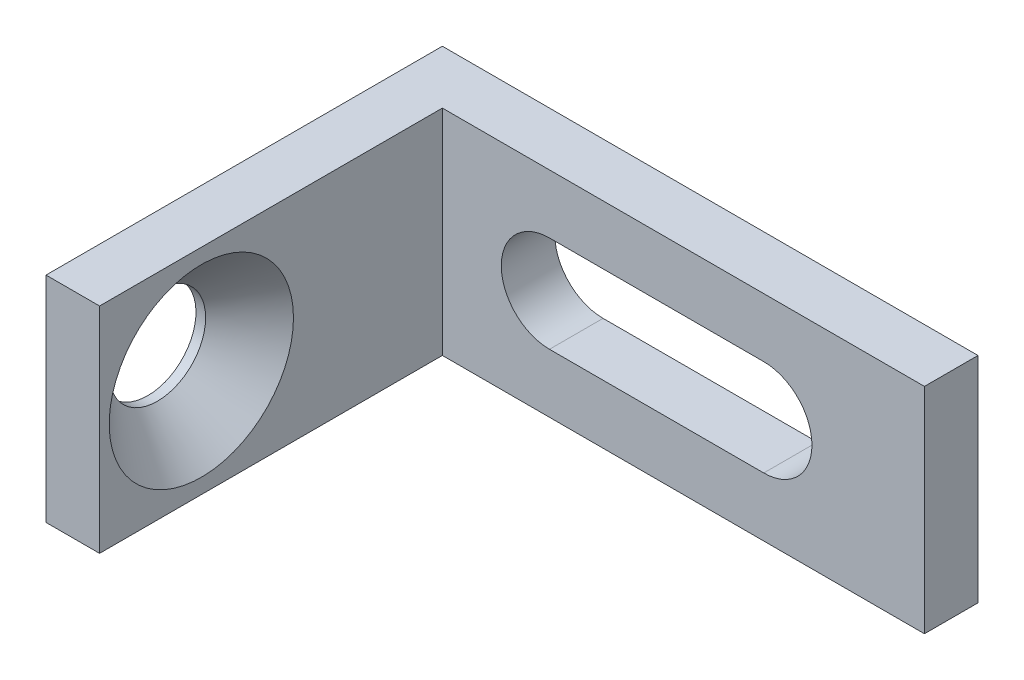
ISO-10303-21;
HEADER;
FILE_DESCRIPTION(('STEP AP214'),'2;1');
FILE_NAME('part.step','',(''),(''),'','','');
FILE_SCHEMA(('AUTOMOTIVE_DESIGN { 1 0 10303 214 1 1 1 1 }'));
ENDSEC;
DATA;
#1=APPLICATION_CONTEXT('core data for automotive mechanical design processes');
#2=APPLICATION_PROTOCOL_DEFINITION('international standard','automotive_design',2000,#1);
#3=PRODUCT_CONTEXT('',#1,'mechanical');
#4=PRODUCT('Part','Part','',(#3));
#5=PRODUCT_RELATED_PRODUCT_CATEGORY('part','',(#4));
#6=PRODUCT_DEFINITION_FORMATION('','',#4);
#7=PRODUCT_DEFINITION_CONTEXT('part definition',#1,'design');
#8=PRODUCT_DEFINITION('design','',#6,#7);
#9=PRODUCT_DEFINITION_SHAPE('','',#8);
#10=(LENGTH_UNIT() NAMED_UNIT(*) SI_UNIT(.MILLI.,.METRE.));
#11=(NAMED_UNIT(*) PLANE_ANGLE_UNIT() SI_UNIT($,.RADIAN.));
#12=(NAMED_UNIT(*) SI_UNIT($,.STERADIAN.) SOLID_ANGLE_UNIT());
#13=UNCERTAINTY_MEASURE_WITH_UNIT(LENGTH_MEASURE(1.E-05),#10,'distance_accuracy_value','');
#14=(GEOMETRIC_REPRESENTATION_CONTEXT(3) GLOBAL_UNCERTAINTY_ASSIGNED_CONTEXT((#13)) GLOBAL_UNIT_ASSIGNED_CONTEXT((#10,
#11,#12)) REPRESENTATION_CONTEXT('',''));
#15=CARTESIAN_POINT('',(0.,0.,0.));
#16=DIRECTION('',(0.,0.,1.));
#17=DIRECTION('',(1.,0.,0.));
#18=AXIS2_PLACEMENT_3D('',#15,#16,#17);
#19=CARTESIAN_POINT('',(5.00000000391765,0.,0.));
#20=DIRECTION('',(1.,0.,0.));
#21=DIRECTION('',(0.,0.,-1.));
#22=AXIS2_PLACEMENT_3D('',#19,#20,#21);
#23=CONICAL_SURFACE('',#22,8.59999999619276,0.785398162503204);
#24=CARTESIAN_POINT('',(5.00000000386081,0.,0.));
#25=DIRECTION('',(1.,0.,0.));
#26=DIRECTION('',(0.,0.,-1.));
#27=AXIS2_PLACEMENT_3D('',#24,#25,#26);
#28=CIRCLE('',#27,8.59999999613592);
#29=CARTESIAN_POINT('',(5.00000000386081,0.,-8.59999999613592));
#30=VERTEX_POINT('',#29);
#31=EDGE_CURVE('E18',#30,#30,#28,.T.);
#32=ORIENTED_EDGE('',*,*,#31,.T.);
#33=EDGE_LOOP('',(#32));
#34=FACE_BOUND('',#33,.T.);
#35=CARTESIAN_POINT('',(0.9,0.,0.));
#36=DIRECTION('',(-1.,0.,0.));
#37=DIRECTION('',(0.,-1.,0.));
#38=AXIS2_PLACEMENT_3D('',#35,#36,#37);
#39=CIRCLE('',#38,4.5);
#40=CARTESIAN_POINT('',(0.899999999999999,-4.5,0.));
#41=VERTEX_POINT('',#40);
#42=EDGE_CURVE('E130',#41,#41,#39,.T.);
#43=ORIENTED_EDGE('',*,*,#42,.T.);
#44=EDGE_LOOP('',(#43));
#45=FACE_BOUND('',#44,.T.);
#46=ADVANCED_FACE('F15',(#34,#45),#23,.F.);
#47=CARTESIAN_POINT('',(2.5,0.,0.));
#48=DIRECTION('',(-1.,0.,0.));
#49=DIRECTION('',(0.,-1.,0.));
#50=AXIS2_PLACEMENT_3D('',#47,#48,#49);
#51=CYLINDRICAL_SURFACE('',#50,4.5);
#52=CARTESIAN_POINT('',(0.,0.,0.));
#53=DIRECTION('',(-1.,0.,0.));
#54=DIRECTION('',(0.,-1.,0.));
#55=AXIS2_PLACEMENT_3D('',#52,#53,#54);
#56=CIRCLE('',#55,4.5);
#57=CARTESIAN_POINT('',(0.,-4.5,0.));
#58=VERTEX_POINT('',#57);
#59=EDGE_CURVE('E142',#58,#58,#56,.T.);
#60=ORIENTED_EDGE('',*,*,#59,.T.);
#61=EDGE_LOOP('',(#60));
#62=FACE_BOUND('',#61,.T.);
#63=ORIENTED_EDGE('',*,*,#42,.F.);
#64=EDGE_LOOP('',(#63));
#65=FACE_BOUND('',#64,.T.);
#66=ADVANCED_FACE('F171',(#62,#65),#51,.F.);
#67=CARTESIAN_POINT('',(2.5,0.,9.5));
#68=DIRECTION('',(0.,0.,1.));
#69=DIRECTION('',(1.,0.,0.));
#70=AXIS2_PLACEMENT_3D('',#67,#68,#69);
#71=PLANE('',#70);
#72=DIRECTION('',(1.,0.,0.));
#73=VECTOR('',#72,1.);
#74=CARTESIAN_POINT('',(2.5,10.,9.5));
#75=LINE('',#74,#73);
#76=CARTESIAN_POINT('',(5.,10.,9.5));
#77=VERTEX_POINT('',#76);
#78=CARTESIAN_POINT('',(0.,10.,9.5));
#79=VERTEX_POINT('',#78);
#80=EDGE_CURVE('E156',#77,#79,#75,.F.);
#81=ORIENTED_EDGE('',*,*,#80,.T.);
#82=DIRECTION('',(0.,1.,0.));
#83=VECTOR('',#82,1.);
#84=CARTESIAN_POINT('',(0.,0.,9.5));
#85=LINE('',#84,#83);
#86=CARTESIAN_POINT('',(0.,-10.,9.5));
#87=VERTEX_POINT('',#86);
#88=EDGE_CURVE('E144',#79,#87,#85,.F.);
#89=ORIENTED_EDGE('',*,*,#88,.T.);
#90=DIRECTION('',(1.,0.,0.));
#91=VECTOR('',#90,1.);
#92=CARTESIAN_POINT('',(2.5,-10.,9.5));
#93=LINE('',#92,#91);
#94=CARTESIAN_POINT('',(5.,-10.,9.5));
#95=VERTEX_POINT('',#94);
#96=EDGE_CURVE('E298',#87,#95,#93,.T.);
#97=ORIENTED_EDGE('',*,*,#96,.T.);
#98=DIRECTION('',(0.,1.,0.));
#99=VECTOR('',#98,1.);
#100=CARTESIAN_POINT('',(5.,0.,9.5));
#101=LINE('',#100,#99);
#102=EDGE_CURVE('E68',#95,#77,#101,.T.);
#103=ORIENTED_EDGE('',*,*,#102,.T.);
#104=EDGE_LOOP('',(#81,#89,#97,#103));
#105=FACE_BOUND('',#104,.T.);
#106=ADVANCED_FACE('F162',(#105),#71,.T.);
#107=CARTESIAN_POINT('',(5.,0.,-9.));
#108=DIRECTION('',(-1.,0.,0.));
#109=DIRECTION('',(0.,0.,1.));
#110=AXIS2_PLACEMENT_3D('',#107,#108,#109);
#111=PLANE('',#110);
#112=ORIENTED_EDGE('',*,*,#31,.F.);
#113=EDGE_LOOP('',(#112));
#114=FACE_BOUND('',#113,.T.);
#115=DIRECTION('',(0.,0.,-1.));
#116=VECTOR('',#115,1.);
#117=CARTESIAN_POINT('',(5.,10.,-9.));
#118=LINE('',#117,#116);
#119=CARTESIAN_POINT('',(5.,9.99999999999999,-22.5));
#120=VERTEX_POINT('',#119);
#121=EDGE_CURVE('E112',#120,#77,#118,.F.);
#122=ORIENTED_EDGE('',*,*,#121,.T.);
#123=ORIENTED_EDGE('',*,*,#102,.F.);
#124=DIRECTION('',(0.,0.,1.));
#125=VECTOR('',#124,1.);
#126=CARTESIAN_POINT('',(5.,-10.,-9.));
#127=LINE('',#126,#125);
#128=CARTESIAN_POINT('',(5.,-10.,-22.5));
#129=VERTEX_POINT('',#128);
#130=EDGE_CURVE('E128',#95,#129,#127,.F.);
#131=ORIENTED_EDGE('',*,*,#130,.T.);
#132=DIRECTION('',(0.,1.,0.));
#133=VECTOR('',#132,1.);
#134=CARTESIAN_POINT('',(5.,0.,-22.5));
#135=LINE('',#134,#133);
#136=EDGE_CURVE('E88',#120,#129,#135,.F.);
#137=ORIENTED_EDGE('',*,*,#136,.F.);
#138=EDGE_LOOP('',(#122,#123,#131,#137));
#139=FACE_BOUND('',#138,.T.);
#140=ADVANCED_FACE('F160',(#114,#139),#111,.F.);
#141=CARTESIAN_POINT('',(25.,0.,-22.5));
#142=DIRECTION('',(0.,0.,1.));
#143=DIRECTION('',(1.,0.,0.));
#144=AXIS2_PLACEMENT_3D('',#141,#142,#143);
#145=PLANE('',#144);
#146=CARTESIAN_POINT('',(35.,0.,-22.5));
#147=DIRECTION('',(0.,0.,1.));
#148=DIRECTION('',(1.,0.,0.));
#149=AXIS2_PLACEMENT_3D('',#146,#147,#148);
#150=CIRCLE('',#149,4.5);
#151=CARTESIAN_POINT('',(35.,4.5,-22.5));
#152=VERTEX_POINT('',#151);
#153=CARTESIAN_POINT('',(35.,-4.50000000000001,-22.5));
#154=VERTEX_POINT('',#153);
#155=EDGE_CURVE('E141',#152,#154,#150,.F.);
#156=ORIENTED_EDGE('',*,*,#155,.T.);
#157=DIRECTION('',(1.,0.,0.));
#158=VECTOR('',#157,1.);
#159=CARTESIAN_POINT('',(35.,-4.50000000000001,-22.5));
#160=LINE('',#159,#158);
#161=CARTESIAN_POINT('',(15.,-4.50000000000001,-22.5));
#162=VERTEX_POINT('',#161);
#163=EDGE_CURVE('E122',#154,#162,#160,.F.);
#164=ORIENTED_EDGE('',*,*,#163,.T.);
#165=CARTESIAN_POINT('',(15.,0.,-22.5));
#166=DIRECTION('',(0.,0.,1.));
#167=DIRECTION('',(1.,0.,0.));
#168=AXIS2_PLACEMENT_3D('',#165,#166,#167);
#169=CIRCLE('',#168,4.5);
#170=CARTESIAN_POINT('',(15.,4.5,-22.5));
#171=VERTEX_POINT('',#170);
#172=EDGE_CURVE('E139',#162,#171,#169,.F.);
#173=ORIENTED_EDGE('',*,*,#172,.T.);
#174=DIRECTION('',(1.,0.,0.));
#175=VECTOR('',#174,1.);
#176=CARTESIAN_POINT('',(15.,4.5,-22.5));
#177=LINE('',#176,#175);
#178=EDGE_CURVE('E59',#171,#152,#177,.T.);
#179=ORIENTED_EDGE('',*,*,#178,.T.);
#180=EDGE_LOOP('',(#156,#164,#173,#179));
#181=FACE_BOUND('',#180,.T.);
#182=DIRECTION('',(0.,1.,0.));
#183=VECTOR('',#182,1.);
#184=CARTESIAN_POINT('',(50.,0.,-22.5));
#185=LINE('',#184,#183);
#186=CARTESIAN_POINT('',(50.,-10.,-22.5));
#187=VERTEX_POINT('',#186);
#188=CARTESIAN_POINT('',(50.,9.99999999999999,-22.5));
#189=VERTEX_POINT('',#188);
#190=EDGE_CURVE('E94',#187,#189,#185,.T.);
#191=ORIENTED_EDGE('',*,*,#190,.T.);
#192=DIRECTION('',(1.,0.,0.));
#193=VECTOR('',#192,1.);
#194=CARTESIAN_POINT('',(2.5,10.,-22.5));
#195=LINE('',#194,#193);
#196=EDGE_CURVE('E97',#189,#120,#195,.F.);
#197=ORIENTED_EDGE('',*,*,#196,.T.);
#198=ORIENTED_EDGE('',*,*,#136,.T.);
#199=DIRECTION('',(1.,0.,0.));
#200=VECTOR('',#199,1.);
#201=CARTESIAN_POINT('',(2.5,-10.,-22.5));
#202=LINE('',#201,#200);
#203=EDGE_CURVE('E99',#129,#187,#202,.T.);
#204=ORIENTED_EDGE('',*,*,#203,.T.);
#205=EDGE_LOOP('',(#191,#197,#198,#204));
#206=FACE_BOUND('',#205,.T.);
#207=ADVANCED_FACE('F96',(#181,#206),#145,.T.);
#208=CARTESIAN_POINT('',(50.,0.,-25.));
#209=DIRECTION('',(-1.,0.,0.));
#210=DIRECTION('',(0.,0.,1.));
#211=AXIS2_PLACEMENT_3D('',#208,#209,#210);
#212=PLANE('',#211);
#213=DIRECTION('',(0.,1.,0.));
#214=VECTOR('',#213,1.);
#215=CARTESIAN_POINT('',(50.,0.,-27.5));
#216=LINE('',#215,#214);
#217=CARTESIAN_POINT('',(50.,-10.,-27.5));
#218=VERTEX_POINT('',#217);
#219=CARTESIAN_POINT('',(50.,9.99999999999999,-27.5));
#220=VERTEX_POINT('',#219);
#221=EDGE_CURVE('E117',#218,#220,#216,.T.);
#222=ORIENTED_EDGE('',*,*,#221,.T.);
#223=DIRECTION('',(0.,0.,-1.));
#224=VECTOR('',#223,1.);
#225=CARTESIAN_POINT('',(50.,10.,-9.));
#226=LINE('',#225,#224);
#227=EDGE_CURVE('E104',#220,#189,#226,.F.);
#228=ORIENTED_EDGE('',*,*,#227,.T.);
#229=ORIENTED_EDGE('',*,*,#190,.F.);
#230=DIRECTION('',(0.,0.,1.));
#231=VECTOR('',#230,1.);
#232=CARTESIAN_POINT('',(50.,-10.,-9.));
#233=LINE('',#232,#231);
#234=EDGE_CURVE('E147',#187,#218,#233,.F.);
#235=ORIENTED_EDGE('',*,*,#234,.T.);
#236=EDGE_LOOP('',(#222,#228,#229,#235));
#237=FACE_BOUND('',#236,.T.);
#238=ADVANCED_FACE('F115',(#237),#212,.F.);
#239=CARTESIAN_POINT('',(2.5,10.,-9.));
#240=DIRECTION('',(0.,-1.,0.));
#241=DIRECTION('',(0.,0.,-1.));
#242=AXIS2_PLACEMENT_3D('',#239,#240,#241);
#243=PLANE('',#242);
#244=ORIENTED_EDGE('',*,*,#80,.F.);
#245=ORIENTED_EDGE('',*,*,#121,.F.);
#246=ORIENTED_EDGE('',*,*,#196,.F.);
#247=ORIENTED_EDGE('',*,*,#227,.F.);
#248=DIRECTION('',(1.,0.,0.));
#249=VECTOR('',#248,1.);
#250=CARTESIAN_POINT('',(2.5,9.99999999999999,-27.5));
#251=LINE('',#250,#249);
#252=CARTESIAN_POINT('',(0.,10.,-27.5));
#253=VERTEX_POINT('',#252);
#254=EDGE_CURVE('E281',#220,#253,#251,.F.);
#255=ORIENTED_EDGE('',*,*,#254,.T.);
#256=DIRECTION('',(0.,0.,-1.));
#257=VECTOR('',#256,1.);
#258=CARTESIAN_POINT('',(0.,10.,-9.));
#259=LINE('',#258,#257);
#260=EDGE_CURVE('E149',#253,#79,#259,.F.);
#261=ORIENTED_EDGE('',*,*,#260,.T.);
#262=EDGE_LOOP('',(#244,#245,#246,#247,#255,#261));
#263=FACE_BOUND('',#262,.T.);
#264=ADVANCED_FACE('F109',(#263),#243,.F.);
#265=CARTESIAN_POINT('',(0.,0.,-9.));
#266=DIRECTION('',(1.,0.,0.));
#267=DIRECTION('',(0.,0.,-1.));
#268=AXIS2_PLACEMENT_3D('',#265,#266,#267);
#269=PLANE('',#268);
#270=ORIENTED_EDGE('',*,*,#59,.F.);
#271=EDGE_LOOP('',(#270));
#272=FACE_BOUND('',#271,.T.);
#273=ORIENTED_EDGE('',*,*,#88,.F.);
#274=ORIENTED_EDGE('',*,*,#260,.F.);
#275=DIRECTION('',(0.,1.,0.));
#276=VECTOR('',#275,1.);
#277=CARTESIAN_POINT('',(0.,0.,-27.5));
#278=LINE('',#277,#276);
#279=CARTESIAN_POINT('',(0.,-10.,-27.5));
#280=VERTEX_POINT('',#279);
#281=EDGE_CURVE('E283',#253,#280,#278,.F.);
#282=ORIENTED_EDGE('',*,*,#281,.T.);
#283=DIRECTION('',(0.,0.,1.));
#284=VECTOR('',#283,1.);
#285=CARTESIAN_POINT('',(0.,-10.,-9.));
#286=LINE('',#285,#284);
#287=EDGE_CURVE('E280',#280,#87,#286,.T.);
#288=ORIENTED_EDGE('',*,*,#287,.T.);
#289=EDGE_LOOP('',(#273,#274,#282,#288));
#290=FACE_BOUND('',#289,.T.);
#291=ADVANCED_FACE('F201',(#272,#290),#269,.F.);
#292=CARTESIAN_POINT('',(2.5,-10.,-9.));
#293=DIRECTION('',(0.,1.,0.));
#294=DIRECTION('',(0.,0.,1.));
#295=AXIS2_PLACEMENT_3D('',#292,#293,#294);
#296=PLANE('',#295);
#297=ORIENTED_EDGE('',*,*,#96,.F.);
#298=ORIENTED_EDGE('',*,*,#287,.F.);
#299=DIRECTION('',(1.,0.,0.));
#300=VECTOR('',#299,1.);
#301=CARTESIAN_POINT('',(2.5,-10.,-27.5));
#302=LINE('',#301,#300);
#303=EDGE_CURVE('E285',#280,#218,#302,.T.);
#304=ORIENTED_EDGE('',*,*,#303,.T.);
#305=ORIENTED_EDGE('',*,*,#234,.F.);
#306=ORIENTED_EDGE('',*,*,#203,.F.);
#307=ORIENTED_EDGE('',*,*,#130,.F.);
#308=EDGE_LOOP('',(#297,#298,#304,#305,#306,#307));
#309=FACE_BOUND('',#308,.T.);
#310=ADVANCED_FACE('F197',(#309),#296,.F.);
#311=CARTESIAN_POINT('',(15.,4.5,-27.5));
#312=DIRECTION('',(0.,1.,0.));
#313=DIRECTION('',(0.,0.,1.));
#314=AXIS2_PLACEMENT_3D('',#311,#312,#313);
#315=PLANE('',#314);
#316=DIRECTION('',(0.,0.,1.));
#317=VECTOR('',#316,1.);
#318=CARTESIAN_POINT('',(15.,4.5,-27.5));
#319=LINE('',#318,#317);
#320=CARTESIAN_POINT('',(15.,4.5,-27.5));
#321=VERTEX_POINT('',#320);
#322=EDGE_CURVE('E124',#171,#321,#319,.F.);
#323=ORIENTED_EDGE('',*,*,#322,.T.);
#324=DIRECTION('',(1.,0.,0.));
#325=VECTOR('',#324,1.);
#326=CARTESIAN_POINT('',(2.5,4.5,-27.5));
#327=LINE('',#326,#325);
#328=CARTESIAN_POINT('',(35.,4.5,-27.5));
#329=VERTEX_POINT('',#328);
#330=EDGE_CURVE('E138',#321,#329,#327,.T.);
#331=ORIENTED_EDGE('',*,*,#330,.T.);
#332=DIRECTION('',(0.,0.,1.));
#333=VECTOR('',#332,1.);
#334=CARTESIAN_POINT('',(35.,4.5,-27.5));
#335=LINE('',#334,#333);
#336=EDGE_CURVE('E127',#329,#152,#335,.T.);
#337=ORIENTED_EDGE('',*,*,#336,.T.);
#338=ORIENTED_EDGE('',*,*,#178,.F.);
#339=EDGE_LOOP('',(#323,#331,#337,#338));
#340=FACE_BOUND('',#339,.T.);
#341=ADVANCED_FACE('F193',(#340),#315,.F.);
#342=CARTESIAN_POINT('',(35.,0.,-27.5));
#343=DIRECTION('',(0.,0.,1.));
#344=DIRECTION('',(1.,0.,0.));
#345=AXIS2_PLACEMENT_3D('',#342,#343,#344);
#346=CYLINDRICAL_SURFACE('',#345,4.5);
#347=ORIENTED_EDGE('',*,*,#336,.F.);
#348=CARTESIAN_POINT('',(35.,0.,-27.5));
#349=DIRECTION('',(0.,0.,1.));
#350=DIRECTION('',(1.,0.,0.));
#351=AXIS2_PLACEMENT_3D('',#348,#349,#350);
#352=CIRCLE('',#351,4.5);
#353=CARTESIAN_POINT('',(35.,-4.50000000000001,-27.5));
#354=VERTEX_POINT('',#353);
#355=EDGE_CURVE('E135',#329,#354,#352,.F.);
#356=ORIENTED_EDGE('',*,*,#355,.T.);
#357=DIRECTION('',(0.,0.,-1.));
#358=VECTOR('',#357,1.);
#359=CARTESIAN_POINT('',(35.,-4.50000000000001,-27.5));
#360=LINE('',#359,#358);
#361=EDGE_CURVE('E125',#354,#154,#360,.F.);
#362=ORIENTED_EDGE('',*,*,#361,.T.);
#363=ORIENTED_EDGE('',*,*,#155,.F.);
#364=EDGE_LOOP('',(#347,#356,#362,#363));
#365=FACE_BOUND('',#364,.T.);
#366=ADVANCED_FACE('F189',(#365),#346,.F.);
#367=CARTESIAN_POINT('',(35.,-4.50000000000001,-27.5));
#368=DIRECTION('',(0.,-1.,0.));
#369=DIRECTION('',(0.,0.,-1.));
#370=AXIS2_PLACEMENT_3D('',#367,#368,#369);
#371=PLANE('',#370);
#372=ORIENTED_EDGE('',*,*,#361,.F.);
#373=DIRECTION('',(1.,0.,0.));
#374=VECTOR('',#373,1.);
#375=CARTESIAN_POINT('',(2.5,-4.50000000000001,-27.5));
#376=LINE('',#375,#374);
#377=CARTESIAN_POINT('',(15.,-4.50000000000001,-27.5));
#378=VERTEX_POINT('',#377);
#379=EDGE_CURVE('E24',#354,#378,#376,.F.);
#380=ORIENTED_EDGE('',*,*,#379,.T.);
#381=DIRECTION('',(0.,0.,1.));
#382=VECTOR('',#381,1.);
#383=CARTESIAN_POINT('',(15.,-4.5,-27.5));
#384=LINE('',#383,#382);
#385=EDGE_CURVE('E32',#378,#162,#384,.T.);
#386=ORIENTED_EDGE('',*,*,#385,.T.);
#387=ORIENTED_EDGE('',*,*,#163,.F.);
#388=EDGE_LOOP('',(#372,#380,#386,#387));
#389=FACE_BOUND('',#388,.T.);
#390=ADVANCED_FACE('F182',(#389),#371,.F.);
#391=CARTESIAN_POINT('',(15.,0.,-27.5));
#392=DIRECTION('',(0.,0.,1.));
#393=DIRECTION('',(1.,0.,0.));
#394=AXIS2_PLACEMENT_3D('',#391,#392,#393);
#395=CYLINDRICAL_SURFACE('',#394,4.5);
#396=ORIENTED_EDGE('',*,*,#385,.F.);
#397=CARTESIAN_POINT('',(15.,0.,-27.5));
#398=DIRECTION('',(0.,0.,1.));
#399=DIRECTION('',(1.,0.,0.));
#400=AXIS2_PLACEMENT_3D('',#397,#398,#399);
#401=CIRCLE('',#400,4.5);
#402=EDGE_CURVE('E10',#378,#321,#401,.F.);
#403=ORIENTED_EDGE('',*,*,#402,.T.);
#404=ORIENTED_EDGE('',*,*,#322,.F.);
#405=ORIENTED_EDGE('',*,*,#172,.F.);
#406=EDGE_LOOP('',(#396,#403,#404,#405));
#407=FACE_BOUND('',#406,.T.);
#408=ADVANCED_FACE('F176',(#407),#395,.F.);
#409=CARTESIAN_POINT('',(2.5,0.,-27.5));
#410=DIRECTION('',(0.,0.,1.));
#411=DIRECTION('',(1.,0.,0.));
#412=AXIS2_PLACEMENT_3D('',#409,#410,#411);
#413=PLANE('',#412);
#414=ORIENTED_EDGE('',*,*,#379,.F.);
#415=ORIENTED_EDGE('',*,*,#355,.F.);
#416=ORIENTED_EDGE('',*,*,#330,.F.);
#417=ORIENTED_EDGE('',*,*,#402,.F.);
#418=EDGE_LOOP('',(#414,#415,#416,#417));
#419=FACE_BOUND('',#418,.T.);
#420=ORIENTED_EDGE('',*,*,#281,.F.);
#421=ORIENTED_EDGE('',*,*,#254,.F.);
#422=ORIENTED_EDGE('',*,*,#221,.F.);
#423=ORIENTED_EDGE('',*,*,#303,.F.);
#424=EDGE_LOOP('',(#420,#421,#422,#423));
#425=FACE_BOUND('',#424,.T.);
#426=ADVANCED_FACE('F174',(#419,#425),#413,.F.);
#427=CLOSED_SHELL('',(#46,#66,#106,#140,#207,#238,#264,#291,#310,#341,#366,#390,#408,#426));
#428=MANIFOLD_SOLID_BREP('B1',#427);
#429=ADVANCED_BREP_SHAPE_REPRESENTATION('',(#18,#428),#14);
#430=SHAPE_DEFINITION_REPRESENTATION(#9,#429);
ENDSEC;
END-ISO-10303-21;
